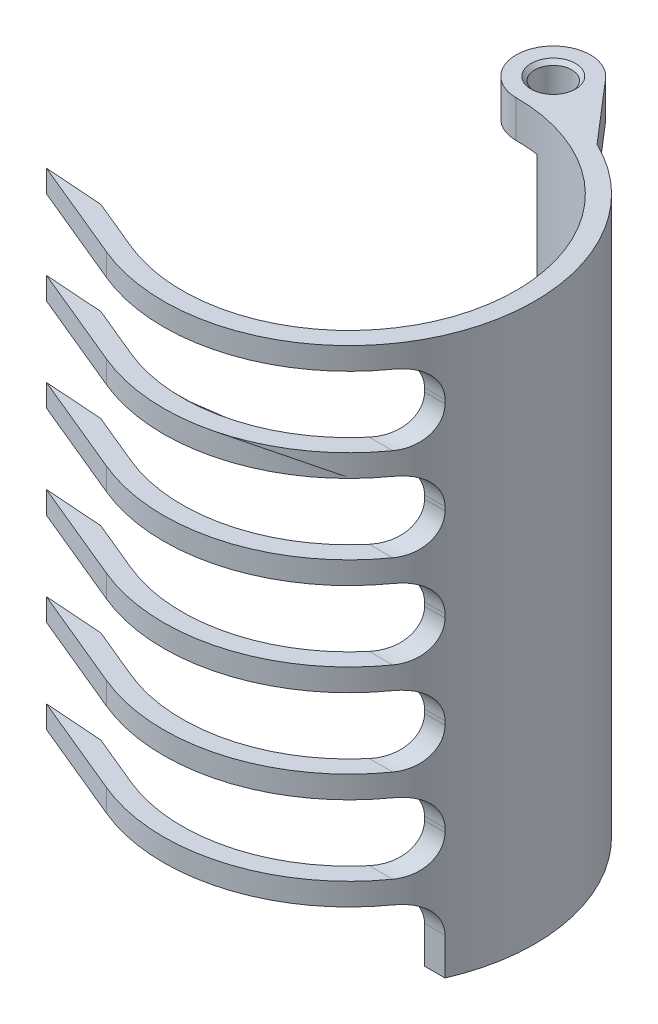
from build123d import *

# Parameters (mm, degrees)
BOSS_EXTRUDE1_DEPTH      = 150
CUT_EXTRUDE1_DEPTH       = 166.831239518
CUT_EXTRUDE1_DEPTH_BACK  = 166.831239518
SKETCH5_R                = 5
BOSS_EXTRUDE5_DEPTH      = 10
CUT_EXTRUDE9_START       = -10
SKETCH6_R                = 12
CUT_EXTRUDE9_DEPTH       = 130
BOSS_EXTRUDE6_START      = -140
SKETCH5_2_R              = 5
BOSS_EXTRUDE6_DEPTH      = 10
CHAMFER1_SIZE            = 1
CHAMFER2_SIZE            = 1
CHAMFER3_SIZE            = 1
CHAMFER4_SIZE            = 1
CUT_EXTRUDE10_DEPTH      = 171.95321009
CUT_EXTRUDE10_DEPTH_BACK = 171.95321009
SKETCH7_W                = 30.217222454
SKETCH7_H                = 10


with BuildPart() as part:
    # Sketch1 → Boss-Extrude1 (new body)
    with BuildSketch(Plane(origin=(0, 0, 0), x_dir=(1, 0, 0), z_dir=(0, 1, 0))):
        with BuildLine():
            Line((0, 50), (0, 45))
            ThreePointArc((0, 45), (44.135337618, -8.779064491), (-17.220754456, -41.574578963))
            Line((-17.220754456, -41.574578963), (-31.078947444, -35.834327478))
            Line((-31.078947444, -35.834327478), (-46.850557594, -34.713473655))
            Line((-46.850557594, -34.713473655), (-19.134171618, -46.193976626))
            ThreePointArc((-19.134171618, -46.193976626), (49.03926402, -9.754516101), (0, 50))
        make_face()
    extrude(amount=BOSS_EXTRUDE1_DEPTH)

    # Sketch2 → Cut-Extrude1 (cut, two sides: drawn at the far end of the back side and taken through both)
    with BuildSketch(Plane(origin=(0, 0, 0), x_dir=(0, 0, -1), z_dir=(1, 0, 0)).offset(-CUT_EXTRUDE1_DEPTH_BACK)):
        with BuildLine():
            Line((-50, 144), (-29, 144))
            ThreePointArc((-29, 144), (-22.636038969, 141.363961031), (-20, 135))
            Line((-20, 135), (-20, 134))
            ThreePointArc((-20, 134), (-22.636038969, 127.636038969), (-29, 125))
            Line((-29, 125), (-50, 125))
            Line((-50, 125), (-50, 144))
        make_face()
        with BuildLine():
            Line((-50, 100), (-29, 100))
            ThreePointArc((-29, 100), (-22.636038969, 102.636038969), (-20, 109))
            Line((-20, 109), (-20, 110))
            ThreePointArc((-20, 110), (-22.636038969, 116.363961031), (-29, 119))
            Line((-29, 119), (-50, 119))
            Line((-50, 119), (-50, 100))
        make_face()
        with BuildLine():
            Line((-50, 75), (-29, 75))
            ThreePointArc((-29, 75), (-22.636038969, 77.636038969), (-20, 84))
            Line((-20, 84), (-20, 85))
            ThreePointArc((-20, 85), (-22.636038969, 91.363961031), (-29, 94))
            Line((-29, 94), (-50, 94))
            Line((-50, 94), (-50, 75))
        make_face()
        with BuildLine():
            Line((-50, 50), (-29, 50))
            ThreePointArc((-29, 50), (-22.636038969, 52.636038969), (-20, 59))
            Line((-20, 59), (-20, 60))
            ThreePointArc((-20, 60), (-22.636038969, 66.363961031), (-29, 69))
            Line((-29, 69), (-50, 69))
            Line((-50, 69), (-50, 50))
        make_face()
        with BuildLine():
            Line((-50, 25), (-29, 25))
            ThreePointArc((-29, 25), (-22.636038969, 27.636038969), (-20, 34))
            Line((-20, 34), (-20, 35))
            ThreePointArc((-20, 35), (-22.636038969, 41.363961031), (-29, 44))
            Line((-29, 44), (-50, 44))
            Line((-50, 44), (-50, 25))
        make_face()
        with BuildLine():
            Line((-50, 0), (-29, 0))
            ThreePointArc((-29, 0), (-22.636038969, 2.636038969), (-20, 9))
            Line((-20, 9), (-20, 10))
            ThreePointArc((-20, 10), (-22.636038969, 16.363961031), (-29, 19))
            Line((-29, 19), (-50, 19))
            Line((-50, 19), (-50, 0))
        make_face()
        with BuildLine():
            Line((-50, -25), (-29, -25))
            ThreePointArc((-29, -25), (-22.636038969, -22.363961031), (-20, -16))
            Line((-20, -16), (-20, -15))
            ThreePointArc((-20, -15), (-22.636038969, -8.636038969), (-29, -6))
            Line((-29, -6), (-50, -6))
            Line((-50, -6), (-50, -25))
        make_face()
        with BuildLine():
            Line((-50, -50), (-29, -50))
            ThreePointArc((-29, -50), (-22.636038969, -47.363961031), (-20, -41))
            Line((-20, -41), (-20, -40))
            ThreePointArc((-20, -40), (-22.636038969, -33.636038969), (-29, -31))
            Line((-29, -31), (-50, -31))
            Line((-50, -31), (-50, -50))
        make_face()
    extrude(amount=CUT_EXTRUDE1_DEPTH + CUT_EXTRUDE1_DEPTH_BACK, mode=Mode.SUBTRACT)

    # Sketch5 → Boss-Extrude5 (add)
    with BuildSketch(Plane(origin=(0, 0, 0), x_dir=(-1, 0, 0), z_dir=(0, -1, 0))):
        with BuildLine():
            Line((-21.794494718, 45), (-7.580693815, 61.52173913))
            ThreePointArc((-7.580693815, 61.52173913), (9.718671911, 57.355295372), (-3.753931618, 45.731343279))
            Line((-3.753931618, 45.731343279), (-21.794494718, 45))
        make_face()
        with Locations(Location((0, 55, 0), (0, 0, 90))):
            Circle(SKETCH5_R, mode=Mode.SUBTRACT)
    extrude(amount=-BOSS_EXTRUDE5_DEPTH)

    # Sketch6 → Cut-Extrude9 (cut)
    with BuildSketch(Plane(origin=(0, 0, 0), x_dir=(-1, 0, 0), z_dir=(0, -1, 0)).offset(CUT_EXTRUDE9_START)):
        with Locations((0, 55)):
            Circle(SKETCH6_R)
    extrude(amount=-CUT_EXTRUDE9_DEPTH, mode=Mode.SUBTRACT)

    # Sketch5_2 → Boss-Extrude6 (add)
    with BuildSketch(Plane(origin=(0, 0, 0), x_dir=(-1, 0, 0), z_dir=(0, -1, 0)).offset(BOSS_EXTRUDE6_START)):
        with BuildLine():
            Line((-21.794494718, 45), (-7.580693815, 61.52173913))
            ThreePointArc((-7.580693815, 61.52173913), (9.718671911, 57.355295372), (-3.753931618, 45.731343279))
            Line((-3.753931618, 45.731343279), (-21.794494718, 45))
        make_face()
        with Locations(Location((0, 55, 0), (0, 0, 90))):
            Circle(SKETCH5_2_R, mode=Mode.SUBTRACT)
    extrude(amount=-BOSS_EXTRUDE6_DEPTH)

    # Chamfer1
    chamfer1_edges = [part.edges().sort_by_distance(p)[0] for p in [
        (0, 0, -50),
    ]]
    chamfer(chamfer1_edges, length=CHAMFER1_SIZE)

    # Chamfer2
    chamfer2_edges = [part.edges().sort_by_distance(p)[0] for p in [
        (0, 10, -50),
    ]]
    chamfer(chamfer2_edges, length=CHAMFER2_SIZE)

    # Chamfer3
    chamfer3_edges = [part.edges().sort_by_distance(p)[0] for p in [
        (0, 140, -50),
    ]]
    chamfer(chamfer3_edges, length=CHAMFER3_SIZE)

    # Chamfer4
    chamfer4_edges = [part.edges().sort_by_distance(p)[0] for p in [
        (0, 150, -50),
    ]]
    chamfer(chamfer4_edges, length=CHAMFER4_SIZE)

    # Sketch7 → Cut-Extrude10 (cut, two sides: drawn at the far end of the back side and taken through both)
    with BuildSketch(Plane(origin=(0, 0, 0), x_dir=(0, 0, -1), z_dir=(1, 0, 0)).offset(-CUT_EXTRUDE10_DEPTH_BACK)):
        with Locations((-35.108611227, 5)):
            Rectangle(SKETCH7_W, SKETCH7_H)
    extrude(amount=CUT_EXTRUDE10_DEPTH + CUT_EXTRUDE10_DEPTH_BACK, mode=Mode.SUBTRACT)


solid = part.part
